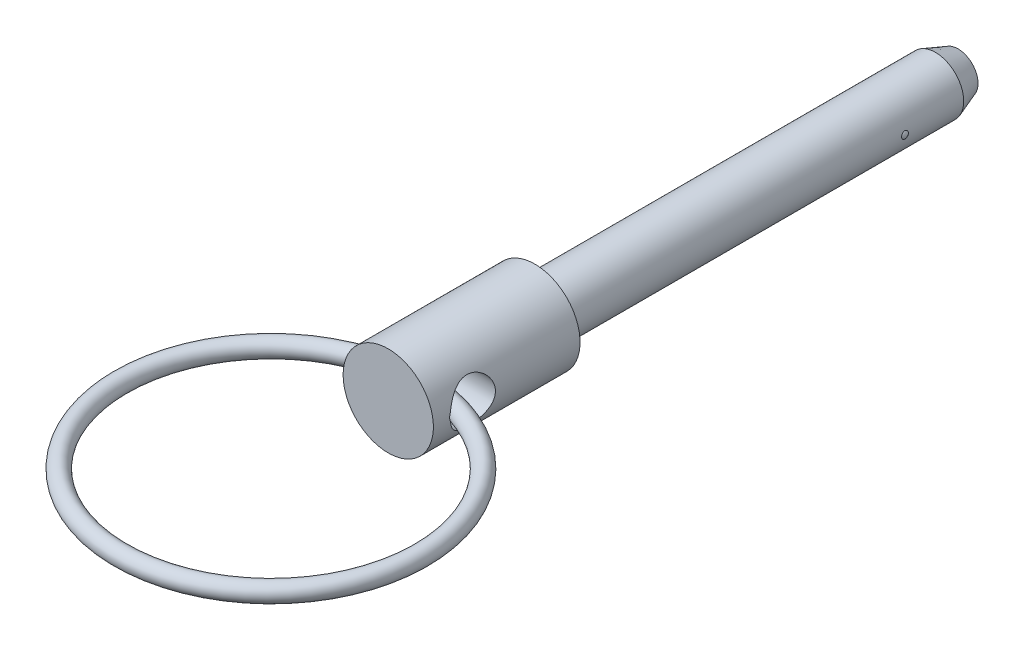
ISO-10303-21;
HEADER;
FILE_DESCRIPTION(('STEP AP214'),'2;1');
FILE_NAME('part.step','',(''),(''),'','','');
FILE_SCHEMA(('AUTOMOTIVE_DESIGN { 1 0 10303 214 1 1 1 1 }'));
ENDSEC;
DATA;
#1=APPLICATION_CONTEXT('core data for automotive mechanical design processes');
#2=APPLICATION_PROTOCOL_DEFINITION('international standard','automotive_design',2000,#1);
#3=PRODUCT_CONTEXT('',#1,'mechanical');
#4=PRODUCT('Part','Part','',(#3));
#5=PRODUCT_RELATED_PRODUCT_CATEGORY('part','',(#4));
#6=PRODUCT_DEFINITION_FORMATION('','',#4);
#7=PRODUCT_DEFINITION_CONTEXT('part definition',#1,'design');
#8=PRODUCT_DEFINITION('design','',#6,#7);
#9=PRODUCT_DEFINITION_SHAPE('','',#8);
#10=(LENGTH_UNIT() NAMED_UNIT(*) SI_UNIT(.MILLI.,.METRE.));
#11=(NAMED_UNIT(*) PLANE_ANGLE_UNIT() SI_UNIT($,.RADIAN.));
#12=(NAMED_UNIT(*) SI_UNIT($,.STERADIAN.) SOLID_ANGLE_UNIT());
#13=UNCERTAINTY_MEASURE_WITH_UNIT(LENGTH_MEASURE(1.E-05),#10,'distance_accuracy_value','');
#14=(GEOMETRIC_REPRESENTATION_CONTEXT(3) GLOBAL_UNCERTAINTY_ASSIGNED_CONTEXT((#13)) GLOBAL_UNIT_ASSIGNED_CONTEXT((#10,
#11,#12)) REPRESENTATION_CONTEXT('',''));
#15=CARTESIAN_POINT('',(0.,0.,0.));
#16=DIRECTION('',(0.,0.,1.));
#17=DIRECTION('',(1.,0.,0.));
#18=AXIS2_PLACEMENT_3D('',#15,#16,#17);
#19=CARTESIAN_POINT('',(0.,0.,14.9758741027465));
#20=DIRECTION('',(0.,0.,1.));
#21=DIRECTION('',(-1.,0.,0.));
#22=AXIS2_PLACEMENT_3D('',#19,#20,#21);
#23=CYLINDRICAL_SURFACE('',#22,4.00000000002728);
#24=CARTESIAN_POINT('',(0.,0.,12.9999999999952));
#25=DIRECTION('',(0.,0.,1.));
#26=DIRECTION('',(-1.,0.,0.));
#27=AXIS2_PLACEMENT_3D('',#24,#25,#26);
#28=CIRCLE('',#27,4.00000000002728);
#29=CARTESIAN_POINT('',(-4.00000000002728,0.,12.9999999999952));
#30=VERTEX_POINT('',#29);
#31=EDGE_CURVE('E61',#30,#30,#28,.T.);
#32=ORIENTED_EDGE('',*,*,#31,.F.);
#33=EDGE_LOOP('',(#32));
#34=FACE_BOUND('',#33,.T.);
#35=CARTESIAN_POINT('',(0.,0.,2.90531487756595E-11));
#36=DIRECTION('',(0.,0.,1.));
#37=DIRECTION('',(-1.,0.,0.));
#38=AXIS2_PLACEMENT_3D('',#35,#36,#37);
#39=CIRCLE('',#38,4.00000000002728);
#40=CARTESIAN_POINT('',(-4.00000000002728,0.,2.90531487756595E-11));
#41=VERTEX_POINT('',#40);
#42=EDGE_CURVE('E114',#41,#41,#39,.T.);
#43=ORIENTED_EDGE('',*,*,#42,.T.);
#44=EDGE_LOOP('',(#43));
#45=FACE_BOUND('',#44,.T.);
#46=CARTESIAN_POINT('',(3.99005038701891,0.281953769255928,9.92986493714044));
#47=CARTESIAN_POINT('',(3.98710361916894,0.323646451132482,9.94537015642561));
#48=CARTESIAN_POINT('',(3.98358785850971,0.364031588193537,9.96435084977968));
#49=CARTESIAN_POINT('',(3.97580260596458,0.441017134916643,10.008790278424));
#50=CARTESIAN_POINT('',(3.97153248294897,0.477614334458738,10.0342544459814));
#51=CARTESIAN_POINT('',(3.96271650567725,0.545954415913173,10.0909789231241));
#52=CARTESIAN_POINT('',(3.95817071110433,0.577698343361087,10.1222379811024));
#53=CARTESIAN_POINT('',(3.94931125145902,0.635450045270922,10.1896824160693));
#54=CARTESIAN_POINT('',(3.94499753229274,0.661459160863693,10.2258666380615));
#55=CARTESIAN_POINT('',(3.93708131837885,0.707055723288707,10.3020868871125));
#56=CARTESIAN_POINT('',(3.93347801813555,0.726650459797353,10.3421184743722));
#57=CARTESIAN_POINT('',(3.92735611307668,0.759043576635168,10.4249158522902));
#58=CARTESIAN_POINT('',(3.92483759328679,0.7718414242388,10.4676818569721));
#59=CARTESIAN_POINT('',(3.92109281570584,0.790648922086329,10.5555243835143));
#60=CARTESIAN_POINT('',(3.91989028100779,0.796534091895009,10.6006284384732));
#61=CARTESIAN_POINT('',(3.91894269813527,0.801182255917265,10.6912124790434));
#62=CARTESIAN_POINT('',(3.91919799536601,0.799943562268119,10.7366925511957));
#63=CARTESIAN_POINT('',(3.92114297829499,0.790356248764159,10.829192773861));
#64=CARTESIAN_POINT('',(3.92290466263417,0.781650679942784,10.8761742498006));
#65=CARTESIAN_POINT('',(3.92772482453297,0.757055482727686,10.9681516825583));
#66=CARTESIAN_POINT('',(3.93078377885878,0.741163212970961,11.0131469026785));
#67=CARTESIAN_POINT('',(3.93806499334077,0.701480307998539,11.1026764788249));
#68=CARTESIAN_POINT('',(3.94234583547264,0.677274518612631,11.1470226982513));
#69=CARTESIAN_POINT('',(3.95147153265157,0.621820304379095,11.2310343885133));
#70=CARTESIAN_POINT('',(3.95631656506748,0.590569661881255,11.2706983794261));
#71=CARTESIAN_POINT('',(3.9660181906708,0.521460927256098,11.3441933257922));
#72=CARTESIAN_POINT('',(3.97087472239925,0.483570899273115,11.3779944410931));
#73=CARTESIAN_POINT('',(3.97994547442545,0.402125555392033,11.4380257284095));
#74=CARTESIAN_POINT('',(3.98416017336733,0.358574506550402,11.4642615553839));
#75=CARTESIAN_POINT('',(3.99101820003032,0.271145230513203,11.5057266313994));
#76=CARTESIAN_POINT('',(3.99376828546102,0.227643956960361,11.5217298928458));
#77=CARTESIAN_POINT('',(3.9978554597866,0.138347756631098,11.5452375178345));
#78=CARTESIAN_POINT('',(3.99919394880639,0.0925551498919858,11.5527503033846));
#79=CARTESIAN_POINT('',(4.00020492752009,0.00564920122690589,11.5584330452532));
#80=CARTESIAN_POINT('',(4.00005022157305,-0.0354012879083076,11.5575719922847));
#81=CARTESIAN_POINT('',(3.99850330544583,-0.116721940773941,11.5488508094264));
#82=CARTESIAN_POINT('',(3.99711125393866,-0.156992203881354,11.5409915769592));
#83=CARTESIAN_POINT('',(3.99330536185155,-0.234470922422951,11.5190218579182));
#84=CARTESIAN_POINT('',(3.99092186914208,-0.271733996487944,11.5050965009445));
#85=CARTESIAN_POINT('',(3.98537855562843,-0.343596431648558,11.4716692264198));
#86=CARTESIAN_POINT('',(3.98221855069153,-0.378195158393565,11.4521659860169));
#87=CARTESIAN_POINT('',(3.97515535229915,-0.446551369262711,11.4066625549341));
#88=CARTESIAN_POINT('',(3.97121432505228,-0.48005403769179,11.380286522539));
#89=CARTESIAN_POINT('',(3.96314004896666,-0.542697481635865,11.3228119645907));
#90=CARTESIAN_POINT('',(3.95900671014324,-0.57183618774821,11.2917112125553));
#91=CARTESIAN_POINT('',(3.95044956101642,-0.628376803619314,11.2218573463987));
#92=CARTESIAN_POINT('',(3.94604615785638,-0.655204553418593,11.1826362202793));
#93=CARTESIAN_POINT('',(3.93791011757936,-0.702452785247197,11.1004353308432));
#94=CARTESIAN_POINT('',(3.93417778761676,-0.72287033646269,11.0574538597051));
#95=CARTESIAN_POINT('',(3.92755557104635,-0.758058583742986,10.9655943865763));
#96=CARTESIAN_POINT('',(3.92474503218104,-0.772320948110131,10.9165145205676));
#97=CARTESIAN_POINT('',(3.92073635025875,-0.792422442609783,10.8165862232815));
#98=CARTESIAN_POINT('',(3.91953811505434,-0.79826205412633,10.765737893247));
#99=CARTESIAN_POINT('',(3.91896964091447,-0.801049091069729,10.6645522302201));
#100=CARTESIAN_POINT('',(3.91957166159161,-0.798131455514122,10.6142190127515));
#101=CARTESIAN_POINT('',(3.92252995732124,-0.783463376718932,10.5149080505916));
#102=CARTESIAN_POINT('',(3.9248854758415,-0.771716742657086,10.4659297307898));
#103=CARTESIAN_POINT('',(3.93088557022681,-0.740520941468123,10.3740211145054));
#104=CARTESIAN_POINT('',(3.93443961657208,-0.721603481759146,10.3309041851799));
#105=CARTESIAN_POINT('',(3.94243966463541,-0.676528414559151,10.2487285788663));
#106=CARTESIAN_POINT('',(3.94688545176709,-0.650372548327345,10.2096689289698));
#107=CARTESIAN_POINT('',(3.95592540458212,-0.592842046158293,10.138445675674));
#108=CARTESIAN_POINT('',(3.96050463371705,-0.561744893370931,10.1060555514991));
#109=CARTESIAN_POINT('',(3.96946431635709,-0.494471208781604,10.0470379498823));
#110=CARTESIAN_POINT('',(3.97384478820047,-0.458295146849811,10.0204099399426));
#111=CARTESIAN_POINT('',(3.98187371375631,-0.382266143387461,9.97385565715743));
#112=CARTESIAN_POINT('',(3.98552868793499,-0.342451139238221,9.95386848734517));
#113=CARTESIAN_POINT('',(3.9917566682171,-0.259975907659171,9.92075319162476));
#114=CARTESIAN_POINT('',(3.99432946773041,-0.217315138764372,9.90762637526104));
#115=CARTESIAN_POINT('',(3.99811926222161,-0.130195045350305,9.88852098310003));
#116=CARTESIAN_POINT('',(3.99933102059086,-0.0857294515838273,9.88257000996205));
#117=CARTESIAN_POINT('',(4.00024701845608,0.00356373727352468,9.87805708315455));
#118=CARTESIAN_POINT('',(3.9999525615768,0.0483909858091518,9.8794887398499));
#119=CARTESIAN_POINT('',(3.99817522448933,0.125082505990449,9.88829599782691));
#120=CARTESIAN_POINT('',(3.99703656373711,0.157163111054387,9.8939529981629));
#121=CARTESIAN_POINT('',(3.99404982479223,0.220379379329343,9.90907748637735));
#122=CARTESIAN_POINT('',(3.9922017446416,0.251515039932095,9.91854498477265));
#123=CARTESIAN_POINT('',(3.99005038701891,0.281953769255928,9.92986493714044));
#124=B_SPLINE_CURVE_WITH_KNOTS('',3,(#46,#47,#48,#49,#50,#51,#52,#53,#54,#55,#56,#57,#58,#59,
#60,#61,#62,#63,#64,#65,#66,#67,#68,#69,#70,#71,#72,#73,#74,#75,#76,#77,#78,#79,#80,#81,#82,#83,
#84,#85,#86,#87,#88,#89,#90,#91,#92,#93,#94,#95,#96,#97,#98,#99,#100,#101,#102,#103,#104,#105,
#106,#107,#108,#109,#110,#111,#112,#113,#114,#115,#116,#117,#118,#119,#120,#121,#122,#123),
.UNSPECIFIED.,.T.,.F.,(4,2,2,2,2,2,2,2,2,2,2,2,2,2,2,2,2,2,2,2,2,2,2,2,2,2,2,2,2,2,2,2,2,2,2,2,
2,2,4),(0.,0.133622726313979,0.267357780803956,0.40106398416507,0.534738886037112,
0.668261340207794,0.801794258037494,0.93769660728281,1.07363115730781,1.2164509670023,
1.35932331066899,1.5107314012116,1.66218722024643,1.8143926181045,1.96648394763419,
2.1049852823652,2.24334911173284,2.36591145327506,2.488458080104,2.60750142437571,
2.72657302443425,2.85451767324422,2.98252280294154,3.12508196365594,3.26770620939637,
3.42053145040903,3.57334795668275,3.72382188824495,3.87423093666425,4.01516707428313,
4.15606933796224,4.29082406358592,4.42556633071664,4.55903651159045,4.69253216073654,
4.82653969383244,4.96043126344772,5.05798542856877,5.15553986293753),.UNSPECIFIED.);
#125=CARTESIAN_POINT('',(3.98515545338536,0.344290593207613,11.4701431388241));
#126=VERTEX_POINT('',#125);
#127=CARTESIAN_POINT('',(3.9851554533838,-0.344290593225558,11.4701431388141));
#128=VERTEX_POINT('',#127);
#129=EDGE_CURVE('E40',#126,#128,#124,.T.);
#130=ORIENTED_EDGE('',*,*,#129,.F.);
#131=CARTESIAN_POINT('',(3.46410161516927,-2.,9.5));
#132=CARTESIAN_POINT('',(3.46411185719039,-1.99999158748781,9.39578679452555));
#133=CARTESIAN_POINT('',(3.46887633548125,-1.99179963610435,9.29143782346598));
#134=CARTESIAN_POINT('',(3.48724701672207,-1.95944672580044,9.08594482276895));
#135=CARTESIAN_POINT('',(3.50087179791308,-1.93525221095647,8.98480799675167));
#136=CARTESIAN_POINT('',(3.53498701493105,-1.87219981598,8.78909684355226));
#137=CARTESIAN_POINT('',(3.55544089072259,-1.83341988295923,8.69449074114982));
#138=CARTESIAN_POINT('',(3.60085327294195,-1.74253507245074,8.51315154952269));
#139=CARTESIAN_POINT('',(3.62581202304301,-1.6904294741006,8.42641888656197));
#140=CARTESIAN_POINT('',(3.679937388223,-1.56933307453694,8.25538855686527));
#141=CARTESIAN_POINT('',(3.70928127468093,-1.49930407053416,8.1718817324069));
#142=CARTESIAN_POINT('',(3.76743965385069,-1.34650761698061,8.01718321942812));
#143=CARTESIAN_POINT('',(3.79625387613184,-1.26373385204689,7.94599767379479));
#144=CARTESIAN_POINT('',(3.8524295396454,-1.080979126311,7.81326569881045));
#145=CARTESIAN_POINT('',(3.879562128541,-0.980214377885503,7.75269246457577));
#146=CARTESIAN_POINT('',(3.92701512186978,-0.768314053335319,7.64971829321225));
#147=CARTESIAN_POINT('',(3.94733982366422,-0.657185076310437,7.60730588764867));
#148=CARTESIAN_POINT('',(3.97760922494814,-0.436089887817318,7.54499067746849));
#149=CARTESIAN_POINT('',(3.98818960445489,-0.326603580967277,7.52370094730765));
#150=CARTESIAN_POINT('',(4.00015167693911,-0.105141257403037,7.49966776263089));
#151=CARTESIAN_POINT('',(4.00153893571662,0.00683321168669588,7.49691308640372));
#152=CARTESIAN_POINT('',(3.99525963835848,0.21966504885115,7.50949334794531));
#153=CARTESIAN_POINT('',(3.98836991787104,0.320642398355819,7.5232760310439));
#154=CARTESIAN_POINT('',(3.96748490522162,0.51862754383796,7.56576168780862));
#155=CARTESIAN_POINT('',(3.95348908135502,0.615635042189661,7.59446577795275));
#156=CARTESIAN_POINT('',(3.91943166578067,0.804618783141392,7.66616513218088));
#157=CARTESIAN_POINT('',(3.89928883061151,0.896506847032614,7.70935262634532));
#158=CARTESIAN_POINT('',(3.85475291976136,1.07195360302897,7.80852683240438));
#159=CARTESIAN_POINT('',(3.83035832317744,1.15550929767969,7.86451812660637));
#160=CARTESIAN_POINT('',(3.77688788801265,1.32034732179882,7.99379070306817));
#161=CARTESIAN_POINT('',(3.74758751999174,1.40066815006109,8.06820605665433));
#162=CARTESIAN_POINT('',(3.68908681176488,1.54820874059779,8.22917944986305));
#163=CARTESIAN_POINT('',(3.65988656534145,1.6154184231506,8.31574674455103));
#164=CARTESIAN_POINT('',(3.60288312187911,1.73901066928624,8.50529638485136));
#165=CARTESIAN_POINT('',(3.57528639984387,1.79443462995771,8.60897204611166));
#166=CARTESIAN_POINT('',(3.52750900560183,1.88663822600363,8.82587534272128));
#167=CARTESIAN_POINT('',(3.50732060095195,1.92343731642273,8.9390928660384));
#168=CARTESIAN_POINT('',(3.47889271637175,1.97436042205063,9.1624290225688));
#169=CARTESIAN_POINT('',(3.46983311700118,1.99005024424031,9.27208223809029));
#170=CARTESIAN_POINT('',(3.46235838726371,2.00303389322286,9.49280268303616));
#171=CARTESIAN_POINT('',(3.46393573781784,2.00034071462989,9.60386885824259));
#172=CARTESIAN_POINT('',(3.47668673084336,1.97807208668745,9.81130783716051));
#173=CARTESIAN_POINT('',(3.48679175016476,1.96037563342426,9.90795890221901));
#174=CARTESIAN_POINT('',(3.51388043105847,1.91139256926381,10.0967355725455));
#175=CARTESIAN_POINT('',(3.5308663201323,1.88010155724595,10.1888597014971));
#176=CARTESIAN_POINT('',(3.57072444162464,1.80329517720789,10.370822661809));
#177=CARTESIAN_POINT('',(3.59383286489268,1.75718812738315,10.46035803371));
#178=CARTESIAN_POINT('',(3.64312238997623,1.65257412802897,10.6309385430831));
#179=CARTESIAN_POINT('',(3.66930506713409,1.59406080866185,10.7119792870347));
#180=CARTESIAN_POINT('',(3.72575996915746,1.45767433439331,10.8739575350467));
#181=CARTESIAN_POINT('',(3.75613166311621,1.37829054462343,10.9535943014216));
#182=CARTESIAN_POINT('',(3.81468469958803,1.20680899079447,11.0988244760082));
#183=CARTESIAN_POINT('',(3.84286530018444,1.11470694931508,11.1644131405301));
#184=CARTESIAN_POINT('',(3.89482723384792,0.917070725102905,11.2811474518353));
#185=CARTESIAN_POINT('',(3.91847283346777,0.811246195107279,11.3318662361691));
#186=CARTESIAN_POINT('',(3.95766709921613,0.591044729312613,11.4142758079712));
#187=CARTESIAN_POINT('',(3.97322287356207,0.476675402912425,11.4459833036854));
#188=CARTESIAN_POINT('',(3.99335016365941,0.253959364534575,11.4867371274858));
#189=CARTESIAN_POINT('',(3.99879855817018,0.146022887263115,11.4975957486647));
#190=CARTESIAN_POINT('',(4.00084260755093,-0.0702519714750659,11.5016865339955));
#191=CARTESIAN_POINT('',(3.99744136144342,-0.178590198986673,11.4949248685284));
#192=CARTESIAN_POINT('',(3.98267937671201,-0.385075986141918,11.4651671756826));
#193=CARTESIAN_POINT('',(3.97185789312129,-0.483424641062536,11.4432702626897));
#194=CARTESIAN_POINT('',(3.94384187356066,-0.674891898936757,11.3853460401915));
#195=CARTESIAN_POINT('',(3.92664642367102,-0.768009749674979,11.3493167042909));
#196=CARTESIAN_POINT('',(3.88651861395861,-0.950846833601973,11.2625457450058));
#197=CARTESIAN_POINT('',(3.86337234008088,-1.04025036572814,11.211240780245));
#198=CARTESIAN_POINT('',(3.81376266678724,-1.20954920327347,11.096084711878));
#199=CARTESIAN_POINT('',(3.78729774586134,-1.28944011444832,11.0322278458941));
#200=CARTESIAN_POINT('',(3.73057218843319,-1.44582833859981,10.8864033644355));
#201=CARTESIAN_POINT('',(3.70019591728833,-1.52119665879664,10.8032658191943));
#202=CARTESIAN_POINT('',(3.64126158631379,-1.65732528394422,10.6251077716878));
#203=CARTESIAN_POINT('',(3.6127051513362,-1.71807266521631,10.530076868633));
#204=CARTESIAN_POINT('',(3.55999186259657,-1.82486714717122,10.3266911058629));
#205=CARTESIAN_POINT('',(3.5360025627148,-1.8703890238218,10.2180100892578));
#206=CARTESIAN_POINT('',(3.50696218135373,-1.92395929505,10.0494218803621));
#207=CARTESIAN_POINT('',(3.49844389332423,-1.93935666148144,9.99235217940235));
#208=CARTESIAN_POINT('',(3.48406059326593,-1.96508069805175,9.87676744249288));
#209=CARTESIAN_POINT('',(3.47819372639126,-1.97541091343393,9.81825344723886));
#210=CARTESIAN_POINT('',(3.47059023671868,-1.9887293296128,9.71639921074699));
#211=CARTESIAN_POINT('',(3.46816389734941,-1.99295091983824,9.67326694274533));
#212=CARTESIAN_POINT('',(3.46491740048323,-1.99858810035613,9.5867643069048));
#213=CARTESIAN_POINT('',(3.46409735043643,-2.00000350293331,9.54339392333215));
#214=CARTESIAN_POINT('',(3.46410161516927,-2.,9.5));
#215=B_SPLINE_CURVE_WITH_KNOTS('',3,(#131,#132,#133,#134,#135,#136,#137,#138,#139,#140,#141,
#142,#143,#144,#145,#146,#147,#148,#149,#150,#151,#152,#153,#154,#155,#156,#157,#158,#159,#160,
#161,#162,#163,#164,#165,#166,#167,#168,#169,#170,#171,#172,#173,#174,#175,#176,#177,#178,#179,
#180,#181,#182,#183,#184,#185,#186,#187,#188,#189,#190,#191,#192,#193,#194,#195,#196,#197,#198,
#199,#200,#201,#202,#203,#204,#205,#206,#207,#208,#209,#210,#211,#212,#213,#214),.UNSPECIFIED.,
.T.,.F.,(4,2,2,2,2,2,2,2,2,2,2,2,2,2,2,2,2,2,2,2,2,2,2,2,2,2,2,2,2,2,2,2,2,2,2,2,2,2,2,2,2,4),
(0.,0.312464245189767,0.625585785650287,0.937057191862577,1.24854545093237,1.58572462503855,
1.92307142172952,2.283157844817,2.64301653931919,2.97726969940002,3.31132047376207,
3.61632194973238,3.92134625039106,4.23059069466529,4.53994598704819,4.87854382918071,
5.21740096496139,5.57777683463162,5.93777548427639,6.26924581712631,6.60048186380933,
6.89548366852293,7.19058104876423,7.49934592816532,7.80826972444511,8.15613487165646,
8.50411729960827,8.8612836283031,9.21813559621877,9.54224540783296,9.86624173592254,
10.1688884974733,10.4715786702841,10.7872150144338,11.1029966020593,11.4502048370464,
11.7977188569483,12.1562149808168,12.3351395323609,12.513938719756,12.6440387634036,
12.7741475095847),.UNSPECIFIED.);
#216=EDGE_CURVE('E52',#128,#126,#215,.T.);
#217=ORIENTED_EDGE('',*,*,#216,.F.);
#218=EDGE_LOOP('',(#130,#217));
#219=FACE_BOUND('',#218,.T.);
#220=CARTESIAN_POINT('',(-3.99005038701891,0.281953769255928,9.92986493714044));
#221=CARTESIAN_POINT('',(-3.99300741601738,0.240095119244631,9.91430139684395));
#222=CARTESIAN_POINT('',(-3.99539394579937,0.196873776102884,9.90222423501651));
#223=CARTESIAN_POINT('',(-3.99875840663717,0.10894998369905,9.88535960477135));
#224=CARTESIAN_POINT('',(-3.99973502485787,0.0642461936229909,9.88057893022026));
#225=CARTESIAN_POINT('',(-4.00017032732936,-0.0253314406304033,9.87843698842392));
#226=CARTESIAN_POINT('',(-3.99962961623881,-0.0702052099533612,9.88107276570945));
#227=CARTESIAN_POINT('',(-3.99709040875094,-0.158855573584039,9.89369477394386));
#228=CARTESIAN_POINT('',(-3.99509218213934,-0.202632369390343,9.90367964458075));
#229=CARTESIAN_POINT('',(-3.9898570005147,-0.287863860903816,9.93075746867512));
#230=CARTESIAN_POINT('',(-3.98661975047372,-0.329318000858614,9.94785211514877));
#231=CARTESIAN_POINT('',(-3.97926488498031,-0.408707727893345,9.98872052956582));
#232=CARTESIAN_POINT('',(-3.97514726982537,-0.446643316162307,10.0124942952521));
#233=CARTESIAN_POINT('',(-3.96650501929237,-0.517804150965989,10.0660180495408));
#234=CARTESIAN_POINT('',(-3.96198162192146,-0.551042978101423,10.0957501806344));
#235=CARTESIAN_POINT('',(-3.95302385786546,-0.612008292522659,10.1604189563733));
#236=CARTESIAN_POINT('',(-3.94858948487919,-0.639735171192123,10.1953552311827));
#237=CARTESIAN_POINT('',(-3.94031345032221,-0.688877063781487,10.2693392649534));
#238=CARTESIAN_POINT('',(-3.93647024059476,-0.710308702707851,10.3083758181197));
#239=CARTESIAN_POINT('',(-3.92977370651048,-0.746470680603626,10.3895111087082));
#240=CARTESIAN_POINT('',(-3.92692040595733,-0.761200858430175,10.4316099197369));
#241=CARTESIAN_POINT('',(-3.92245555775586,-0.783887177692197,10.5182713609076));
#242=CARTESIAN_POINT('',(-3.92086162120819,-0.791747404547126,10.5628599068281));
#243=CARTESIAN_POINT('',(-3.91911143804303,-0.800365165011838,10.652740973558));
#244=CARTESIAN_POINT('',(-3.91895550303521,-0.80112115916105,10.698033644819));
#245=CARTESIAN_POINT('',(-3.92007796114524,-0.795611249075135,10.7902748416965));
#246=CARTESIAN_POINT('',(-3.92142316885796,-0.789018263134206,10.837202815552));
#247=CARTESIAN_POINT('',(-3.92546548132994,-0.768652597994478,10.9294151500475));
#248=CARTESIAN_POINT('',(-3.92816306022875,-0.754877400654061,10.9746989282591));
#249=CARTESIAN_POINT('',(-3.93479992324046,-0.719508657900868,11.0652695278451));
#250=CARTESIAN_POINT('',(-3.93880557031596,-0.697485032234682,11.1103840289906));
#251=CARTESIAN_POINT('',(-3.94752061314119,-0.646337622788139,11.196342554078));
#252=CARTESIAN_POINT('',(-3.95223026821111,-0.617211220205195,11.2371849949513));
#253=CARTESIAN_POINT('',(-3.96188534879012,-0.551879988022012,11.3139586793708));
#254=CARTESIAN_POINT('',(-3.96683340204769,-0.515564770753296,11.349796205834));
#255=CARTESIAN_POINT('',(-3.97625988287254,-0.436941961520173,11.414255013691));
#256=CARTESIAN_POINT('',(-3.98073857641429,-0.39463779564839,11.4428803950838));
#257=CARTESIAN_POINT('',(-3.98829005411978,-0.308636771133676,11.4895001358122));
#258=CARTESIAN_POINT('',(-3.99144495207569,-0.265302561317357,11.5081469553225));
#259=CARTESIAN_POINT('',(-3.99638413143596,-0.175817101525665,11.5368761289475));
#260=CARTESIAN_POINT('',(-3.99816989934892,-0.129668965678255,11.5469677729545));
#261=CARTESIAN_POINT('',(-3.99999419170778,-0.0417967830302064,11.5572584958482));
#262=CARTESIAN_POINT('',(-4.00021432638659,-0.000194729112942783,11.5584860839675));
#263=CARTESIAN_POINT('',(-3.99936155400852,0.0825703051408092,11.5536924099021));
#264=CARTESIAN_POINT('',(-3.9982889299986,0.123733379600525,11.5476727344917));
#265=CARTESIAN_POINT('',(-3.99505363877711,0.202575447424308,11.5291543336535));
#266=CARTESIAN_POINT('',(-3.99294152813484,0.240327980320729,11.5169554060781));
#267=CARTESIAN_POINT('',(-3.98787194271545,0.31340150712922,11.4868260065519));
#268=CARTESIAN_POINT('',(-3.98491430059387,0.348722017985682,11.4688943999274));
#269=CARTESIAN_POINT('',(-3.97822434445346,0.418368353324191,11.4267056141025));
#270=CARTESIAN_POINT('',(-3.9744550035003,0.452491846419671,11.4021214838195));
#271=CARTESIAN_POINT('',(-3.96662805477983,0.516631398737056,11.3481231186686));
#272=CARTESIAN_POINT('',(-3.96257031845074,0.54664560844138,11.3187067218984));
#273=CARTESIAN_POINT('',(-3.9540631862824,0.605276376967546,11.2522992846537));
#274=CARTESIAN_POINT('',(-3.94962143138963,0.633350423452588,11.214827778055));
#275=CARTESIAN_POINT('',(-3.9412701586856,0.68339933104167,11.135950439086));
#276=CARTESIAN_POINT('',(-3.93736090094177,0.705371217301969,11.0945427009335));
#277=CARTESIAN_POINT('',(-3.93019522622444,0.744305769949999,11.0052774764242));
#278=CARTESIAN_POINT('',(-3.9270182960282,0.760712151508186,10.9571694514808));
#279=CARTESIAN_POINT('',(-3.92216984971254,0.785329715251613,10.8588172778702));
#280=CARTESIAN_POINT('',(-3.92049838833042,0.793540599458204,10.8085730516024));
#281=CARTESIAN_POINT('',(-3.91892501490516,0.801276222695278,10.7075574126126));
#282=CARTESIAN_POINT('',(-3.91901674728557,0.800832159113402,10.6567885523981));
#283=CARTESIAN_POINT('',(-3.92100845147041,0.791023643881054,10.5561554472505));
#284=CARTESIAN_POINT('',(-3.9229076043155,0.781663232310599,10.5062908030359));
#285=CARTESIAN_POINT('',(-3.9281461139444,0.754877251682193,10.4121456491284));
#286=CARTESIAN_POINT('',(-3.93139064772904,0.737977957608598,10.3677100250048));
#287=CARTESIAN_POINT('',(-3.93892368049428,0.696648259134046,10.2825763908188));
#288=CARTESIAN_POINT('',(-3.94321208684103,0.672218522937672,10.2418780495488));
#289=CARTESIAN_POINT('',(-3.95208501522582,0.617853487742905,10.1674080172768));
#290=CARTESIAN_POINT('',(-3.95664517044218,0.588241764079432,10.1333964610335));
#291=CARTESIAN_POINT('',(-3.96570971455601,0.523645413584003,10.0709664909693));
#292=CARTESIAN_POINT('',(-3.97021415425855,0.488666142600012,10.0425425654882));
#293=CARTESIAN_POINT('',(-3.97742706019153,0.425180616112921,9.99940040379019));
#294=CARTESIAN_POINT('',(-3.9802769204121,0.397749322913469,9.98310007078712));
#295=CARTESIAN_POINT('',(-3.98553180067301,0.341095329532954,9.95389443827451));
#296=CARTESIAN_POINT('',(-3.9879368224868,0.311872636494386,9.94098912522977));
#297=CARTESIAN_POINT('',(-3.99005038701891,0.281953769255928,9.92986493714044));
#298=B_SPLINE_CURVE_WITH_KNOTS('',3,(#220,#221,#222,#223,#224,#225,#226,#227,#228,#229,#230,
#231,#232,#233,#234,#235,#236,#237,#238,#239,#240,#241,#242,#243,#244,#245,#246,#247,#248,#249,
#250,#251,#252,#253,#254,#255,#256,#257,#258,#259,#260,#261,#262,#263,#264,#265,#266,#267,#268,
#269,#270,#271,#272,#273,#274,#275,#276,#277,#278,#279,#280,#281,#282,#283,#284,#285,#286,#287,
#288,#289,#290,#291,#292,#293,#294,#295,#296,#297),.UNSPECIFIED.,.T.,.F.,(4,2,2,2,2,2,2,2,2,2,2,
2,2,2,2,2,2,2,2,2,2,2,2,2,2,2,2,2,2,2,2,2,2,2,2,2,2,2,4),(0.,0.134152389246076,
0.268429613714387,0.402653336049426,0.536852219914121,0.671083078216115,0.805313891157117,
0.939148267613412,1.07297313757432,1.20644134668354,1.33991276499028,1.4752191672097,
1.61055488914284,1.75216328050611,1.89382135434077,2.04422271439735,2.19467961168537,
2.34765655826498,2.50054634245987,2.64157513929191,2.78245059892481,2.90667081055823,
3.03086382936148,3.14953805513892,3.26823578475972,3.39440010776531,3.52062102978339,
3.66112536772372,3.80169808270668,3.95376166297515,4.10583077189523,4.25735183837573,
4.4088042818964,4.55102684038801,4.6932367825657,4.82856596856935,4.96376098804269,
5.05964806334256,5.15553475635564),.UNSPECIFIED.);
#299=CARTESIAN_POINT('',(-3.98515545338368,-0.344290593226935,11.4701431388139));
#300=VERTEX_POINT('',#299);
#301=CARTESIAN_POINT('',(-3.98515545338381,0.344290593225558,11.4701431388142));
#302=VERTEX_POINT('',#301);
#303=EDGE_CURVE('E56',#300,#302,#298,.T.);
#304=ORIENTED_EDGE('',*,*,#303,.F.);
#305=CARTESIAN_POINT('',(-4.00000000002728,0.,7.5));
#306=CARTESIAN_POINT('',(-3.9999942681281,-0.105143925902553,7.50000660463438));
#307=CARTESIAN_POINT('',(-3.99580982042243,-0.2104131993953,7.50834014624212));
#308=CARTESIAN_POINT('',(-3.97948312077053,-0.417840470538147,7.54130576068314));
#309=CARTESIAN_POINT('',(-3.96732575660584,-0.519992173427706,7.56596878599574));
#310=CARTESIAN_POINT('',(-3.93632558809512,-0.717867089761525,7.63038761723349));
#311=CARTESIAN_POINT('',(-3.91750878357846,-0.81361360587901,7.67008476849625));
#312=CARTESIAN_POINT('',(-3.87491553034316,-0.996945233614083,7.76314124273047));
#313=CARTESIAN_POINT('',(-3.85113947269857,-1.08453098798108,7.81649948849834));
#314=CARTESIAN_POINT('',(-3.79912516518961,-1.25501563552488,7.93903449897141));
#315=CARTESIAN_POINT('',(-3.7707039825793,-1.33731042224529,8.00897295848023));
#316=CARTESIAN_POINT('',(-3.71319940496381,-1.48955888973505,8.16104295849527));
#317=CARTESIAN_POINT('',(-3.68411552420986,-1.55950316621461,8.24318370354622));
#318=CARTESIAN_POINT('',(-3.6259790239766,-1.6905040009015,8.42496669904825));
#319=CARTESIAN_POINT('',(-3.59710373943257,-1.75045067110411,8.52547219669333));
#320=CARTESIAN_POINT('',(-3.54571957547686,-1.852336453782,8.73673467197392));
#321=CARTESIAN_POINT('',(-3.5232061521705,-1.89428842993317,8.84748425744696));
#322=CARTESIAN_POINT('',(-3.48915734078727,-1.95626488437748,9.06933021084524));
#323=CARTESIAN_POINT('',(-3.47704543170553,-1.9774517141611,9.18000890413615));
#324=CARTESIAN_POINT('',(-3.46363779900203,-2.00085398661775,9.40395767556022));
#325=CARTESIAN_POINT('',(-3.46233138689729,-2.00308817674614,9.51722508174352));
#326=CARTESIAN_POINT('',(-3.4702186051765,-1.98937457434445,9.72857204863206));
#327=CARTESIAN_POINT('',(-3.47817527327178,-1.97556911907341,9.82684806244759));
#328=CARTESIAN_POINT('',(-3.50152457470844,-1.93387969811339,10.0194438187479));
#329=CARTESIAN_POINT('',(-3.51691957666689,-1.90599124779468,10.1137622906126));
#330=CARTESIAN_POINT('',(-3.55374952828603,-1.83641956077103,10.2984582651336));
#331=CARTESIAN_POINT('',(-3.57531681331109,-1.79443013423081,10.388692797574));
#332=CARTESIAN_POINT('',(-3.62206808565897,-1.69808337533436,10.5612685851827));
#333=CARTESIAN_POINT('',(-3.64725369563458,-1.64372048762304,10.6436062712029));
#334=CARTESIAN_POINT('',(-3.70226315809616,-1.51613210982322,10.8090425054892));
#335=CARTESIAN_POINT('',(-3.73227020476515,-1.441388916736,10.890913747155));
#336=CARTESIAN_POINT('',(-3.79095246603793,-1.2791111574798,11.0414708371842));
#337=CARTESIAN_POINT('',(-3.81962703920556,-1.19157051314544,11.1101503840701));
#338=CARTESIAN_POINT('',(-3.87403974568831,-1.00103301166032,11.2353713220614));
#339=CARTESIAN_POINT('',(-3.89957968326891,-0.897507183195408,11.2912009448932));
#340=CARTESIAN_POINT('',(-3.94315762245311,-0.680932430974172,11.3841940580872));
#341=CARTESIAN_POINT('',(-3.96120157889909,-0.567891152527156,11.4213723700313));
#342=CARTESIAN_POINT('',(-3.98648667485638,-0.345532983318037,11.4729508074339));
#343=CARTESIAN_POINT('',(-3.99449876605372,-0.236683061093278,11.488982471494));
#344=CARTESIAN_POINT('',(-4.00146026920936,-0.0175591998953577,11.502929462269));
#345=CARTESIAN_POINT('',(-4.00041397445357,0.0927140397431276,11.5008533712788));
#346=CARTESIAN_POINT('',(-3.98982384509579,0.302465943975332,11.479586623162));
#347=CARTESIAN_POINT('',(-3.98094491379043,0.402118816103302,11.4617349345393));
#348=CARTESIAN_POINT('',(-3.95644342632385,0.596813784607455,11.4115238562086));
#349=CARTESIAN_POINT('',(-3.94082012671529,0.691855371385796,11.3791628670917));
#350=CARTESIAN_POINT('',(-3.90368502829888,0.877777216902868,11.3000030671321));
#351=CARTESIAN_POINT('',(-3.88201763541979,0.968460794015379,11.2528178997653));
#352=CARTESIAN_POINT('',(-3.83487948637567,1.14092272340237,11.1457849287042));
#353=CARTESIAN_POINT('',(-3.80940711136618,1.22269725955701,11.0859317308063));
#354=CARTESIAN_POINT('',(-3.75416442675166,1.38353537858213,10.948479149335));
#355=CARTESIAN_POINT('',(-3.72421769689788,1.46154415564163,10.8697142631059));
#356=CARTESIAN_POINT('',(-3.66524783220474,1.60371264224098,10.7001496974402));
#357=CARTESIAN_POINT('',(-3.63622534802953,1.66786277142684,10.6093417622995));
#358=CARTESIAN_POINT('',(-3.58102384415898,1.7834158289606,10.412712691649));
#359=CARTESIAN_POINT('',(-3.55505059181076,1.83405099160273,10.306377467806));
#360=CARTESIAN_POINT('',(-3.51148144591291,1.91616565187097,10.0849798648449));
#361=CARTESIAN_POINT('',(-3.49387476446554,1.94766983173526,9.96992894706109));
#362=CARTESIAN_POINT('',(-3.47123002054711,1.98772337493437,9.74617955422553));
#363=CARTESIAN_POINT('',(-3.46514766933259,1.99818599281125,9.6379314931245));
#364=CARTESIAN_POINT('',(-3.46330709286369,2.00137830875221,9.42110586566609));
#365=CARTESIAN_POINT('',(-3.46754439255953,1.99411569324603,9.31252846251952));
#366=CARTESIAN_POINT('',(-3.48475724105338,1.96385225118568,9.10903299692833));
#367=CARTESIAN_POINT('',(-3.49686188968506,1.94241662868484,9.01379905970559));
#368=CARTESIAN_POINT('',(-3.52742032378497,1.88635071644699,8.8283837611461));
#369=CARTESIAN_POINT('',(-3.54587615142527,1.85171618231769,8.73820403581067));
#370=CARTESIAN_POINT('',(-3.58857060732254,1.76763149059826,8.55875029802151));
#371=CARTESIAN_POINT('',(-3.61311444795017,1.71734227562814,8.46994419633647));
#372=CARTESIAN_POINT('',(-3.66470663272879,1.60430194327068,8.30145092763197));
#373=CARTESIAN_POINT('',(-3.69175627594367,1.54154434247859,8.22176853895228));
#374=CARTESIAN_POINT('',(-3.74924646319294,1.3964066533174,8.06371603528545));
#375=CARTESIAN_POINT('',(-3.77969966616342,1.31256884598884,7.98668179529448));
#376=CARTESIAN_POINT('',(-3.83755504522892,1.13230961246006,7.84747403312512));
#377=CARTESIAN_POINT('',(-3.86495557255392,1.03588144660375,7.78530852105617));
#378=CARTESIAN_POINT('',(-3.91396019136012,0.831863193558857,7.67752727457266));
#379=CARTESIAN_POINT('',(-3.93552192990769,0.724199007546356,7.63203166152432));
#380=CARTESIAN_POINT('',(-3.97002682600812,0.501484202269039,7.56038366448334));
#381=CARTESIAN_POINT('',(-3.98299446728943,0.386455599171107,7.53417630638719));
#382=CARTESIAN_POINT('',(-3.9939092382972,0.225203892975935,7.51220517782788));
#383=CARTESIAN_POINT('',(-3.99618730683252,0.180323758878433,7.50763471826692));
#384=CARTESIAN_POINT('',(-3.99923393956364,0.0903034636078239,7.50153066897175));
#385=CARTESIAN_POINT('',(-4.0000024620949,0.0451632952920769,7.49999716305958));
#386=CARTESIAN_POINT('',(-4.00000000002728,0.,7.5));
#387=B_SPLINE_CURVE_WITH_KNOTS('',3,(#305,#306,#307,#308,#309,#310,#311,#312,#313,#314,#315,
#316,#317,#318,#319,#320,#321,#322,#323,#324,#325,#326,#327,#328,#329,#330,#331,#332,#333,#334,
#335,#336,#337,#338,#339,#340,#341,#342,#343,#344,#345,#346,#347,#348,#349,#350,#351,#352,#353,
#354,#355,#356,#357,#358,#359,#360,#361,#362,#363,#364,#365,#366,#367,#368,#369,#370,#371,#372,
#373,#374,#375,#376,#377,#378,#379,#380,#381,#382,#383,#384,#385,#386),.UNSPECIFIED.,.T.,.F.,(4,
2,2,2,2,2,2,2,2,2,2,2,2,2,2,2,2,2,2,2,2,2,2,2,2,2,2,2,2,2,2,2,2,2,2,2,2,2,2,2,4),(0.,
0.315248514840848,0.631096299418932,0.945724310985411,1.26032752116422,1.59396351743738,
1.92785247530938,2.28763452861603,2.64715895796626,2.98516024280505,3.3228271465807,
3.62011424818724,3.91749607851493,4.22180480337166,4.52625042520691,4.86929882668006,
5.21251069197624,5.57166044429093,5.93052433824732,6.25966580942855,6.58865129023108,
6.89213813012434,7.19565843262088,7.50785712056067,7.82018901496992,8.16319221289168,
8.5064317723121,8.86629364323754,9.22569023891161,9.55058615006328,9.87534119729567,
10.1691586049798,10.4630705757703,10.7767291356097,11.0905512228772,11.4425048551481,
11.7946476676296,12.1492802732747,12.5028981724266,12.6383056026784,12.7737167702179),.UNSPECIFIED.);
#388=EDGE_CURVE('E59',#302,#300,#387,.T.);
#389=ORIENTED_EDGE('',*,*,#388,.F.);
#390=EDGE_LOOP('',(#304,#389));
#391=FACE_BOUND('',#390,.T.);
#392=ADVANCED_FACE('F14',(#34,#45,#219,#391),#23,.T.);
#393=CARTESIAN_POINT('',(5.,0.,9.5));
#394=DIRECTION('',(-1.,0.,0.));
#395=DIRECTION('',(0.,-1.,0.));
#396=AXIS2_PLACEMENT_3D('',#393,#394,#395);
#397=CYLINDRICAL_SURFACE('',#396,2.);
#398=ORIENTED_EDGE('',*,*,#388,.T.);
#399=CARTESIAN_POINT('',(-4.01108315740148,-0.369511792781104,11.4655688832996));
#400=CARTESIAN_POINT('',(-3.99021138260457,-0.350083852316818,11.4692147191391));
#401=CARTESIAN_POINT('',(-3.97024619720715,-0.329516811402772,11.4727888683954));
#402=CARTESIAN_POINT('',(-3.93275440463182,-0.285678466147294,11.4796199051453));
#403=CARTESIAN_POINT('',(-3.91527020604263,-0.262370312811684,11.4828710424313));
#404=CARTESIAN_POINT('',(-3.88395406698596,-0.213038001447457,11.4887768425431));
#405=CARTESIAN_POINT('',(-3.87014971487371,-0.186995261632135,11.4914269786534));
#406=CARTESIAN_POINT('',(-3.84773626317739,-0.132819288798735,11.4957673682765));
#407=CARTESIAN_POINT('',(-3.83909292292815,-0.104701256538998,11.4974639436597));
#408=CARTESIAN_POINT('',(-3.82934402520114,-0.0542447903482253,11.4993828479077));
#409=CARTESIAN_POINT('',(-3.8269137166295,-0.0321704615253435,11.499863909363));
#410=CARTESIAN_POINT('',(-3.82579163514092,0.0120958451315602,11.500085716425));
#411=CARTESIAN_POINT('',(-3.82710196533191,0.034287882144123,11.4998260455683));
#412=CARTESIAN_POINT('',(-3.83333881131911,0.0780566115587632,11.498595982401));
#413=CARTESIAN_POINT('',(-3.83825432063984,0.0996349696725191,11.4976277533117));
#414=CARTESIAN_POINT('',(-3.8512832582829,0.141760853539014,11.4950816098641));
#415=CARTESIAN_POINT('',(-3.85939921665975,0.162307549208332,11.4935032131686));
#416=CARTESIAN_POINT('',(-3.88251041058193,0.210921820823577,11.489056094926));
#417=CARTESIAN_POINT('',(-3.89895987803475,0.238271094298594,11.4859257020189));
#418=CARTESIAN_POINT('',(-3.93589373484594,0.289965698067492,11.4790416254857));
#419=CARTESIAN_POINT('',(-3.9563842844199,0.314306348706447,11.4752869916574));
#420=CARTESIAN_POINT('',(-3.98891907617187,0.348315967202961,11.4694667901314));
#421=CARTESIAN_POINT('',(-3.99986593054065,0.359074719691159,11.467529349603));
#422=CARTESIAN_POINT('',(-4.01108315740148,0.369511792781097,11.4655688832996));
#423=B_SPLINE_CURVE_WITH_KNOTS('',3,(#399,#400,#401,#402,#403,#404,#405,#406,#407,#408,#409,
#410,#411,#412,#413,#414,#415,#416,#417,#418,#419,#420,#421,#422),.UNSPECIFIED.,.F.,.F.,(4,2,2,
2,2,2,2,2,2,2,2,4),(0.,0.0863607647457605,0.174054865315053,0.262389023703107,0.350130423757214,
0.41645969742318,0.482826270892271,0.548991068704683,0.615208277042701,0.710869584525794,
0.806677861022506,0.853049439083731),.UNSPECIFIED.);
#424=EDGE_CURVE('E33',#300,#302,#423,.T.);
#425=ORIENTED_EDGE('',*,*,#424,.T.);
#426=EDGE_LOOP('',(#398,#425));
#427=FACE_BOUND('',#426,.T.);
#428=ORIENTED_EDGE('',*,*,#216,.T.);
#429=CARTESIAN_POINT('',(4.01108315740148,0.369511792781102,11.4655688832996));
#430=CARTESIAN_POINT('',(3.99021138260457,0.35008385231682,11.4692147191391));
#431=CARTESIAN_POINT('',(3.97024619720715,0.329516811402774,11.4727888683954));
#432=CARTESIAN_POINT('',(3.93275440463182,0.285678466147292,11.4796199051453));
#433=CARTESIAN_POINT('',(3.91527020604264,0.262370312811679,11.4828710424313));
#434=CARTESIAN_POINT('',(3.88395406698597,0.213038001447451,11.4887768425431));
#435=CARTESIAN_POINT('',(3.87014971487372,0.186995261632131,11.4914269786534));
#436=CARTESIAN_POINT('',(3.84773626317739,0.132819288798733,11.4957673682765));
#437=CARTESIAN_POINT('',(3.83909292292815,0.104701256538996,11.4974639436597));
#438=CARTESIAN_POINT('',(3.82934402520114,0.0542447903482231,11.4993828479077));
#439=CARTESIAN_POINT('',(3.82691371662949,0.0321704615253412,11.499863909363));
#440=CARTESIAN_POINT('',(3.82579163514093,-0.0120958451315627,11.500085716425));
#441=CARTESIAN_POINT('',(3.82710196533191,-0.0342878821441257,11.4998260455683));
#442=CARTESIAN_POINT('',(3.83333881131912,-0.0780566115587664,11.498595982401));
#443=CARTESIAN_POINT('',(3.83825432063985,-0.0996349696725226,11.4976277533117));
#444=CARTESIAN_POINT('',(3.8512832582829,-0.141760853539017,11.4950816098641));
#445=CARTESIAN_POINT('',(3.85939921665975,-0.162307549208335,11.4935032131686));
#446=CARTESIAN_POINT('',(3.88251041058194,-0.210921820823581,11.489056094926));
#447=CARTESIAN_POINT('',(3.89895987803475,-0.238271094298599,11.4859257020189));
#448=CARTESIAN_POINT('',(3.93589373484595,-0.289965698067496,11.4790416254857));
#449=CARTESIAN_POINT('',(3.9563842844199,-0.314306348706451,11.4752869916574));
#450=CARTESIAN_POINT('',(3.98891907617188,-0.348315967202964,11.4694667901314));
#451=CARTESIAN_POINT('',(3.99986593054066,-0.359074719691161,11.467529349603));
#452=CARTESIAN_POINT('',(4.01108315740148,-0.369511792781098,11.4655688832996));
#453=B_SPLINE_CURVE_WITH_KNOTS('',3,(#429,#430,#431,#432,#433,#434,#435,#436,#437,#438,#439,
#440,#441,#442,#443,#444,#445,#446,#447,#448,#449,#450,#451,#452),.UNSPECIFIED.,.F.,.F.,(4,2,2,
2,2,2,2,2,2,2,2,4),(0.,0.0863607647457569,0.17405486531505,0.262389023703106,0.350130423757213,
0.416459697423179,0.48282627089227,0.548991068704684,0.615208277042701,0.710869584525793,
0.806677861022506,0.85304943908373),.UNSPECIFIED.);
#454=EDGE_CURVE('E46',#126,#128,#453,.T.);
#455=ORIENTED_EDGE('',*,*,#454,.T.);
#456=EDGE_LOOP('',(#428,#455));
#457=FACE_BOUND('',#456,.T.);
#458=ADVANCED_FACE('F58',(#427,#457),#397,.F.);
#459=CARTESIAN_POINT('',(0.,0.,14.9758741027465));
#460=DIRECTION('',(0.,0.,1.));
#461=DIRECTION('',(-1.,0.,0.));
#462=AXIS2_PLACEMENT_3D('',#459,#460,#461);
#463=CYLINDRICAL_SURFACE('',#462,2.4999797);
#464=CARTESIAN_POINT('',(2.47854667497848,-0.326657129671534,-30.30003045));
#465=CARTESIAN_POINT('',(2.47854700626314,-0.326655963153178,-30.3164932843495));
#466=CARTESIAN_POINT('',(2.47874269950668,-0.325180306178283,-30.3329729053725));
#467=CARTESIAN_POINT('',(2.479501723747,-0.319339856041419,-30.3654189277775));
#468=CARTESIAN_POINT('',(2.48006564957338,-0.314970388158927,-30.3813844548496));
#469=CARTESIAN_POINT('',(2.48148901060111,-0.303551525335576,-30.4122606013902));
#470=CARTESIAN_POINT('',(2.48234765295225,-0.296509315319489,-30.4271739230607));
#471=CARTESIAN_POINT('',(2.48426009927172,-0.280033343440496,-30.4555892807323));
#472=CARTESIAN_POINT('',(2.48531386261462,-0.270600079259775,-30.4690916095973));
#473=CARTESIAN_POINT('',(2.48750023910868,-0.249701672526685,-30.4943611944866));
#474=CARTESIAN_POINT('',(2.48863269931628,-0.23824040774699,-30.5061316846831));
#475=CARTESIAN_POINT('',(2.49086582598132,-0.213631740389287,-30.5277524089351));
#476=CARTESIAN_POINT('',(2.49196648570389,-0.200483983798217,-30.5376022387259));
#477=CARTESIAN_POINT('',(2.49411877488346,-0.171737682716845,-30.5559476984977));
#478=CARTESIAN_POINT('',(2.49515918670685,-0.15602685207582,-30.5642686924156));
#479=CARTESIAN_POINT('',(2.49698106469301,-0.123490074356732,-30.5783717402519));
#480=CARTESIAN_POINT('',(2.49776243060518,-0.106663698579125,-30.5841528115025));
#481=CARTESIAN_POINT('',(2.49903703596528,-0.0710736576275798,-30.5934285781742));
#482=CARTESIAN_POINT('',(2.49950533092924,-0.0522579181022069,-30.5967275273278));
#483=CARTESIAN_POINT('',(2.50001059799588,-0.0143339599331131,-30.6002822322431));
#484=CARTESIAN_POINT('',(2.50004745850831,0.00477433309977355,-30.6005372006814));
#485=CARTESIAN_POINT('',(2.49967861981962,0.043533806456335,-30.5979493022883));
#486=CARTESIAN_POINT('',(2.4992554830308,0.0631768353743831,-30.594984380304));
#487=CARTESIAN_POINT('',(2.49798548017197,0.101676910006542,-30.5857987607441));
#488=CARTESIAN_POINT('',(2.49713858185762,0.120533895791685,-30.5795778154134));
#489=CARTESIAN_POINT('',(2.49512848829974,0.156708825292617,-30.564043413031));
#490=CARTESIAN_POINT('',(2.49396828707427,0.174039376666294,-30.554759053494));
#491=CARTESIAN_POINT('',(2.49146927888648,0.206757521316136,-30.5332467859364));
#492=CARTESIAN_POINT('',(2.49013052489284,0.222145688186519,-30.5210197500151));
#493=CARTESIAN_POINT('',(2.48752981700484,0.249545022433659,-30.4946883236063));
#494=CARTESIAN_POINT('',(2.48626792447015,0.261700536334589,-30.480734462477));
#495=CARTESIAN_POINT('',(2.48390693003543,0.283236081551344,-30.450814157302));
#496=CARTESIAN_POINT('',(2.48280772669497,0.292617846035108,-30.434848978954));
#497=CARTESIAN_POINT('',(2.48100672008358,0.307499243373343,-30.4028228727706));
#498=CARTESIAN_POINT('',(2.48027911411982,0.313260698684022,-30.3868849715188));
#499=CARTESIAN_POINT('',(2.47918259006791,0.321824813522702,-30.3542223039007));
#500=CARTESIAN_POINT('',(2.47881349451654,0.324628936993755,-30.3374979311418));
#501=CARTESIAN_POINT('',(2.47849376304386,0.327060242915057,-30.3049667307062));
#502=CARTESIAN_POINT('',(2.47851631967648,0.326890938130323,-30.2891750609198));
#503=CARTESIAN_POINT('',(2.47891182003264,0.3238780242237,-30.257855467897));
#504=CARTESIAN_POINT('',(2.47928471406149,0.32103479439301,-30.2423275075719));
#505=CARTESIAN_POINT('',(2.48032929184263,0.312860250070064,-30.2122223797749));
#506=CARTESIAN_POINT('',(2.48099611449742,0.307569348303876,-30.1976339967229));
#507=CARTESIAN_POINT('',(2.48255561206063,0.294716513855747,-30.1695103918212));
#508=CARTESIAN_POINT('',(2.48344831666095,0.287154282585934,-30.1559753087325));
#509=CARTESIAN_POINT('',(2.48540810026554,0.269676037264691,-30.1297456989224));
#510=CARTESIAN_POINT('',(2.48648071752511,0.259678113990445,-30.1171062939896));
#511=CARTESIAN_POINT('',(2.48866494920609,0.237835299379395,-30.0935464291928));
#512=CARTESIAN_POINT('',(2.48977657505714,0.225989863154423,-30.0826264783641));
#513=CARTESIAN_POINT('',(2.49201556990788,0.199852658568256,-30.0619462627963));
#514=CARTESIAN_POINT('',(2.49313795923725,0.185444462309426,-30.052332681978));
#515=CARTESIAN_POINT('',(2.49519694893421,0.155303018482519,-30.035451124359));
#516=CARTESIAN_POINT('',(2.49613348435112,0.139569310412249,-30.0281839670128));
#517=CARTESIAN_POINT('',(2.49779619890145,0.105913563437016,-30.0156180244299));
#518=CARTESIAN_POINT('',(2.49850029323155,0.087916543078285,-30.0105168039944));
#519=CARTESIAN_POINT('',(2.49951970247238,0.0513318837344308,-30.0032146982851));
#520=CARTESIAN_POINT('',(2.49983489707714,0.0327440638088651,-30.0010147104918));
#521=CARTESIAN_POINT('',(2.50005053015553,-0.00552959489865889,-29.9995032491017));
#522=CARTESIAN_POINT('',(2.49992838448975,-0.0252219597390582,-30.0003490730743));
#523=CARTESIAN_POINT('',(2.49923142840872,-0.0641937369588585,-30.0052737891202));
#524=CARTESIAN_POINT('',(2.49865654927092,-0.0834730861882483,-30.0093531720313));
#525=CARTESIAN_POINT('',(2.49711189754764,-0.121201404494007,-30.0207347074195));
#526=CARTESIAN_POINT('',(2.49613922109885,-0.139643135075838,-30.0280605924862));
#527=CARTESIAN_POINT('',(2.4939136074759,-0.174946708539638,-30.045827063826));
#528=CARTESIAN_POINT('',(2.49266072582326,-0.191808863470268,-30.0562670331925));
#529=CARTESIAN_POINT('',(2.49009147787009,-0.222648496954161,-30.0795378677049));
#530=CARTESIAN_POINT('',(2.48878024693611,-0.236719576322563,-30.0922449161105));
#531=CARTESIAN_POINT('',(2.48621473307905,-0.262298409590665,-30.1200364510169));
#532=CARTESIAN_POINT('',(2.48496043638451,-0.273806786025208,-30.1351203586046));
#533=CARTESIAN_POINT('',(2.48277540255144,-0.292934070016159,-30.165945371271));
#534=CARTESIAN_POINT('',(2.48182685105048,-0.300789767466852,-30.1815384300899));
#535=CARTESIAN_POINT('',(2.4802514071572,-0.313517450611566,-30.2138934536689));
#536=CARTESIAN_POINT('',(2.47962381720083,-0.318395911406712,-30.2306527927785));
#537=CARTESIAN_POINT('',(2.47898367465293,-0.323327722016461,-30.256322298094));
#538=CARTESIAN_POINT('',(2.4788204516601,-0.324574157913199,-30.2650144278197));
#539=CARTESIAN_POINT('',(2.47860186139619,-0.326239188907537,-30.2824795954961));
#540=CARTESIAN_POINT('',(2.47854649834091,-0.326657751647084,-30.291252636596));
#541=CARTESIAN_POINT('',(2.47854667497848,-0.326657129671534,-30.30003045));
#542=B_SPLINE_CURVE_WITH_KNOTS('',3,(#464,#465,#466,#467,#468,#469,#470,#471,#472,#473,#474,
#475,#476,#477,#478,#479,#480,#481,#482,#483,#484,#485,#486,#487,#488,#489,#490,#491,#492,#493,
#494,#495,#496,#497,#498,#499,#500,#501,#502,#503,#504,#505,#506,#507,#508,#509,#510,#511,#512,
#513,#514,#515,#516,#517,#518,#519,#520,#521,#522,#523,#524,#525,#526,#527,#528,#529,#530,#531,
#532,#533,#534,#535,#536,#537,#538,#539,#540,#541),.UNSPECIFIED.,.T.,.F.,(4,2,2,2,2,2,2,2,2,2,2,
2,2,2,2,2,2,2,2,2,2,2,2,2,2,2,2,2,2,2,2,2,2,2,2,2,2,2,4),(0.,0.0493517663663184,
0.0987834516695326,0.148083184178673,0.197372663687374,0.246568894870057,0.295775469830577,
0.348973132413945,0.402191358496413,0.459261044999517,0.51634549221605,0.575671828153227,
0.635002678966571,0.693785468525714,0.752550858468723,0.807898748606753,0.863211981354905,
0.913832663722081,0.964428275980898,1.01157529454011,1.05871562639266,1.10510398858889,
1.15149845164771,1.19974491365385,1.24800563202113,1.29985620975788,1.35172487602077,
1.40763626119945,1.46356493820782,1.52242246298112,1.5812889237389,1.64059299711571,
1.69988533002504,1.75659740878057,1.81329569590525,1.8654778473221,1.91754610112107,
1.94385892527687,1.97017277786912),.UNSPECIFIED.);
#543=CARTESIAN_POINT('',(2.47854667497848,-0.326657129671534,-30.30003045));
#544=VERTEX_POINT('',#543);
#545=EDGE_CURVE('E27',#544,#544,#542,.T.);
#546=ORIENTED_EDGE('',*,*,#545,.F.);
#547=EDGE_LOOP('',(#546));
#548=FACE_BOUND('',#547,.T.);
#549=CARTESIAN_POINT('',(0.,0.,2.90531487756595E-11));
#550=DIRECTION('',(0.,0.,1.));
#551=DIRECTION('',(-1.,0.,0.));
#552=AXIS2_PLACEMENT_3D('',#549,#550,#551);
#553=CIRCLE('',#552,2.4999797);
#554=CARTESIAN_POINT('',(-2.4999797,0.,2.90531487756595E-11));
#555=VERTEX_POINT('',#554);
#556=EDGE_CURVE('E117',#555,#555,#553,.T.);
#557=ORIENTED_EDGE('',*,*,#556,.F.);
#558=EDGE_LOOP('',(#557));
#559=FACE_BOUND('',#558,.T.);
#560=CARTESIAN_POINT('',(0.,0.,-35.5));
#561=DIRECTION('',(0.,0.,1.));
#562=DIRECTION('',(-1.,0.,0.));
#563=AXIS2_PLACEMENT_3D('',#560,#561,#562);
#564=CIRCLE('',#563,2.4999797);
#565=CARTESIAN_POINT('',(-2.4999797,0.,-35.5));
#566=VERTEX_POINT('',#565);
#567=EDGE_CURVE('E119',#566,#566,#564,.T.);
#568=ORIENTED_EDGE('',*,*,#567,.T.);
#569=EDGE_LOOP('',(#568));
#570=FACE_BOUND('',#569,.T.);
#571=CARTESIAN_POINT('',(-2.47854667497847,0.32665712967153,-30.30003045));
#572=CARTESIAN_POINT('',(-2.47854700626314,0.326655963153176,-30.3164932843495));
#573=CARTESIAN_POINT('',(-2.47874269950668,0.325180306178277,-30.3329729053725));
#574=CARTESIAN_POINT('',(-2.47950172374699,0.319339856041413,-30.3654189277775));
#575=CARTESIAN_POINT('',(-2.48006564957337,0.314970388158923,-30.3813844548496));
#576=CARTESIAN_POINT('',(-2.4814890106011,0.303551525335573,-30.4122606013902));
#577=CARTESIAN_POINT('',(-2.48234765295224,0.296509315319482,-30.4271739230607));
#578=CARTESIAN_POINT('',(-2.48426009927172,0.280033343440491,-30.4555892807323));
#579=CARTESIAN_POINT('',(-2.48531386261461,0.270600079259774,-30.4690916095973));
#580=CARTESIAN_POINT('',(-2.48750023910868,0.249701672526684,-30.4943611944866));
#581=CARTESIAN_POINT('',(-2.48863269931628,0.238240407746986,-30.5061316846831));
#582=CARTESIAN_POINT('',(-2.49086582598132,0.213631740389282,-30.5277524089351));
#583=CARTESIAN_POINT('',(-2.49196648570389,0.200483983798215,-30.5376022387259));
#584=CARTESIAN_POINT('',(-2.49411877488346,0.171737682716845,-30.5559476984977));
#585=CARTESIAN_POINT('',(-2.49515918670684,0.156026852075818,-30.5642686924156));
#586=CARTESIAN_POINT('',(-2.49698106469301,0.12349007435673,-30.5783717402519));
#587=CARTESIAN_POINT('',(-2.49776243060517,0.106663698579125,-30.5841528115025));
#588=CARTESIAN_POINT('',(-2.49903703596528,0.0710736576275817,-30.5934285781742));
#589=CARTESIAN_POINT('',(-2.49950533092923,0.0522579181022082,-30.5967275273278));
#590=CARTESIAN_POINT('',(-2.50001059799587,0.0143339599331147,-30.6002822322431));
#591=CARTESIAN_POINT('',(-2.5000474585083,-0.00477433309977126,-30.6005372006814));
#592=CARTESIAN_POINT('',(-2.49967861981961,-0.043533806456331,-30.5979493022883));
#593=CARTESIAN_POINT('',(-2.49925548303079,-0.0631768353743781,-30.594984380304));
#594=CARTESIAN_POINT('',(-2.49798548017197,-0.101676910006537,-30.5857987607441));
#595=CARTESIAN_POINT('',(-2.49713858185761,-0.120533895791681,-30.5795778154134));
#596=CARTESIAN_POINT('',(-2.49512848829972,-0.156708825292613,-30.564043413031));
#597=CARTESIAN_POINT('',(-2.49396828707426,-0.174039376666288,-30.554759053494));
#598=CARTESIAN_POINT('',(-2.49146927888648,-0.20675752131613,-30.5332467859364));
#599=CARTESIAN_POINT('',(-2.49013052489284,-0.222145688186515,-30.5210197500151));
#600=CARTESIAN_POINT('',(-2.48752981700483,-0.249545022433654,-30.4946883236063));
#601=CARTESIAN_POINT('',(-2.48626792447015,-0.261700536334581,-30.480734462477));
#602=CARTESIAN_POINT('',(-2.48390693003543,-0.283236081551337,-30.450814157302));
#603=CARTESIAN_POINT('',(-2.48280772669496,-0.292617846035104,-30.434848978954));
#604=CARTESIAN_POINT('',(-2.48100672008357,-0.30749924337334,-30.4028228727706));
#605=CARTESIAN_POINT('',(-2.48027911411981,-0.313260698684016,-30.3868849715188));
#606=CARTESIAN_POINT('',(-2.47918259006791,-0.321824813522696,-30.3542223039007));
#607=CARTESIAN_POINT('',(-2.47881349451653,-0.324628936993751,-30.3374979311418));
#608=CARTESIAN_POINT('',(-2.47849376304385,-0.327060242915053,-30.3049667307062));
#609=CARTESIAN_POINT('',(-2.47851631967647,-0.326890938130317,-30.2891750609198));
#610=CARTESIAN_POINT('',(-2.47891182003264,-0.323878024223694,-30.257855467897));
#611=CARTESIAN_POINT('',(-2.47928471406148,-0.321034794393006,-30.2423275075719));
#612=CARTESIAN_POINT('',(-2.48032929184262,-0.312860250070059,-30.2122223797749));
#613=CARTESIAN_POINT('',(-2.48099611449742,-0.307569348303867,-30.1976339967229));
#614=CARTESIAN_POINT('',(-2.48255561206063,-0.294716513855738,-30.1695103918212));
#615=CARTESIAN_POINT('',(-2.48344831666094,-0.287154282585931,-30.1559753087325));
#616=CARTESIAN_POINT('',(-2.48540810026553,-0.26967603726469,-30.1297456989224));
#617=CARTESIAN_POINT('',(-2.4864807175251,-0.25967811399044,-30.1171062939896));
#618=CARTESIAN_POINT('',(-2.48866494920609,-0.23783529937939,-30.0935464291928));
#619=CARTESIAN_POINT('',(-2.48977657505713,-0.225989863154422,-30.0826264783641));
#620=CARTESIAN_POINT('',(-2.49201556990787,-0.199852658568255,-30.0619462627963));
#621=CARTESIAN_POINT('',(-2.49313795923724,-0.185444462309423,-30.052332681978));
#622=CARTESIAN_POINT('',(-2.49519694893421,-0.155303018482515,-30.035451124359));
#623=CARTESIAN_POINT('',(-2.49613348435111,-0.139569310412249,-30.0281839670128));
#624=CARTESIAN_POINT('',(-2.49779619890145,-0.105913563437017,-30.0156180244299));
#625=CARTESIAN_POINT('',(-2.49850029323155,-0.0879165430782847,-30.0105168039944));
#626=CARTESIAN_POINT('',(-2.49951970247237,-0.0513318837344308,-30.0032146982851));
#627=CARTESIAN_POINT('',(-2.49983489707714,-0.0327440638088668,-30.0010147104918));
#628=CARTESIAN_POINT('',(-2.50005053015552,0.00552959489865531,-29.9995032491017));
#629=CARTESIAN_POINT('',(-2.49992838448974,0.0252219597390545,-30.0003490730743));
#630=CARTESIAN_POINT('',(-2.49923142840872,0.0641937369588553,-30.0052737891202));
#631=CARTESIAN_POINT('',(-2.49865654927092,0.0834730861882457,-30.0093531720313));
#632=CARTESIAN_POINT('',(-2.49711189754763,0.121201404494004,-30.0207347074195));
#633=CARTESIAN_POINT('',(-2.49613922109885,0.139643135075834,-30.0280605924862));
#634=CARTESIAN_POINT('',(-2.49391360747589,0.174946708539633,-30.045827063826));
#635=CARTESIAN_POINT('',(-2.49266072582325,0.191808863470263,-30.0562670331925));
#636=CARTESIAN_POINT('',(-2.49009147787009,0.222648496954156,-30.0795378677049));
#637=CARTESIAN_POINT('',(-2.4887802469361,0.236719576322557,-30.0922449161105));
#638=CARTESIAN_POINT('',(-2.48621473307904,0.26229840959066,-30.1200364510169));
#639=CARTESIAN_POINT('',(-2.4849604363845,0.273806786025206,-30.1351203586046));
#640=CARTESIAN_POINT('',(-2.48277540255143,0.292934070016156,-30.165945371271));
#641=CARTESIAN_POINT('',(-2.48182685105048,0.300789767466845,-30.1815384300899));
#642=CARTESIAN_POINT('',(-2.4802514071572,0.313517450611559,-30.2138934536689));
#643=CARTESIAN_POINT('',(-2.47962381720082,0.318395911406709,-30.2306527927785));
#644=CARTESIAN_POINT('',(-2.47898367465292,0.323327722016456,-30.256322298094));
#645=CARTESIAN_POINT('',(-2.47882045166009,0.324574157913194,-30.2650144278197));
#646=CARTESIAN_POINT('',(-2.47860186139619,0.326239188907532,-30.2824795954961));
#647=CARTESIAN_POINT('',(-2.4785464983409,0.32665775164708,-30.291252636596));
#648=CARTESIAN_POINT('',(-2.47854667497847,0.32665712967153,-30.30003045));
#649=B_SPLINE_CURVE_WITH_KNOTS('',3,(#571,#572,#573,#574,#575,#576,#577,#578,#579,#580,#581,
#582,#583,#584,#585,#586,#587,#588,#589,#590,#591,#592,#593,#594,#595,#596,#597,#598,#599,#600,
#601,#602,#603,#604,#605,#606,#607,#608,#609,#610,#611,#612,#613,#614,#615,#616,#617,#618,#619,
#620,#621,#622,#623,#624,#625,#626,#627,#628,#629,#630,#631,#632,#633,#634,#635,#636,#637,#638,
#639,#640,#641,#642,#643,#644,#645,#646,#647,#648),.UNSPECIFIED.,.T.,.F.,(4,2,2,2,2,2,2,2,2,2,2,
2,2,2,2,2,2,2,2,2,2,2,2,2,2,2,2,2,2,2,2,2,2,2,2,2,2,2,4),(0.,0.0493517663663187,
0.0987834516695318,0.14808318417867,0.197372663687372,0.246568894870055,0.295775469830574,
0.348973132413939,0.402191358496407,0.459261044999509,0.51634549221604,0.575671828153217,
0.635002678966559,0.693785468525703,0.75255085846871,0.807898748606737,0.863211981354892,
0.913832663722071,0.964428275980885,1.01157529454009,1.05871562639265,1.10510398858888,
1.15149845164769,1.19974491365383,1.24800563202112,1.29985620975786,1.35172487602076,
1.40763626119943,1.46356493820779,1.52242246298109,1.58128892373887,1.64059299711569,
1.69988533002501,1.75659740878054,1.81329569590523,1.86547784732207,1.91754610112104,
1.94385892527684,1.97017277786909),.UNSPECIFIED.);
#650=CARTESIAN_POINT('',(-2.47854667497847,0.32665712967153,-30.30003045));
#651=VERTEX_POINT('',#650);
#652=EDGE_CURVE('E9',#651,#651,#649,.T.);
#653=ORIENTED_EDGE('',*,*,#652,.F.);
#654=EDGE_LOOP('',(#653));
#655=FACE_BOUND('',#654,.T.);
#656=ADVANCED_FACE('F80',(#548,#559,#570,#655),#463,.T.);
#657=CARTESIAN_POINT('',(1.77203802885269,0.,-37.5));
#658=DIRECTION('',(0.,0.,1.));
#659=DIRECTION('',(-1.,0.,0.));
#660=AXIS2_PLACEMENT_3D('',#657,#658,#659);
#661=PLANE('',#660);
#662=CARTESIAN_POINT('',(0.,0.,-37.5));
#663=DIRECTION('',(0.,0.,1.));
#664=DIRECTION('',(-1.,0.,0.));
#665=AXIS2_PLACEMENT_3D('',#662,#663,#664);
#666=CIRCLE('',#665,1.77203802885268);
#667=CARTESIAN_POINT('',(-1.77203802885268,0.,-37.5));
#668=VERTEX_POINT('',#667);
#669=EDGE_CURVE('E69',#668,#668,#666,.T.);
#670=ORIENTED_EDGE('',*,*,#669,.F.);
#671=EDGE_LOOP('',(#670));
#672=FACE_BOUND('',#671,.T.);
#673=ADVANCED_FACE('F16',(#672),#661,.F.);
#674=CARTESIAN_POINT('',(0.,0.,-37.5));
#675=DIRECTION('',(0.,0.,1.));
#676=DIRECTION('',(-1.,0.,0.));
#677=AXIS2_PLACEMENT_3D('',#674,#675,#676);
#678=CONICAL_SURFACE('',#677,1.77203802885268,0.349066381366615);
#679=ORIENTED_EDGE('',*,*,#567,.F.);
#680=EDGE_LOOP('',(#679));
#681=FACE_BOUND('',#680,.T.);
#682=ORIENTED_EDGE('',*,*,#669,.T.);
#683=EDGE_LOOP('',(#682));
#684=FACE_BOUND('',#683,.T.);
#685=ADVANCED_FACE('F136',(#681,#684),#678,.T.);
#686=CARTESIAN_POINT('',(4.00000000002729,0.,2.90535481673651E-11));
#687=DIRECTION('',(0.,0.,1.));
#688=DIRECTION('',(-1.,0.,0.));
#689=AXIS2_PLACEMENT_3D('',#686,#687,#688);
#690=PLANE('',#689);
#691=ORIENTED_EDGE('',*,*,#42,.F.);
#692=EDGE_LOOP('',(#691));
#693=FACE_BOUND('',#692,.T.);
#694=ORIENTED_EDGE('',*,*,#556,.T.);
#695=EDGE_LOOP('',(#694));
#696=FACE_BOUND('',#695,.T.);
#697=ADVANCED_FACE('F135',(#693,#696),#690,.F.);
#698=CARTESIAN_POINT('',(4.00000000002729,0.,12.9999999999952));
#699=DIRECTION('',(0.,0.,-1.));
#700=DIRECTION('',(1.,0.,0.));
#701=AXIS2_PLACEMENT_3D('',#698,#699,#700);
#702=PLANE('',#701);
#703=ORIENTED_EDGE('',*,*,#31,.T.);
#704=EDGE_LOOP('',(#703));
#705=FACE_BOUND('',#704,.T.);
#706=ADVANCED_FACE('F83',(#705),#702,.F.);
#707=CARTESIAN_POINT('',(2.09998985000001,0.,-30.30003045));
#708=DIRECTION('',(0.,0.,1.));
#709=DIRECTION('',(1.,0.,0.));
#710=AXIS2_PLACEMENT_3D('',#707,#708,#709);
#711=SPHERICAL_SURFACE('',#710,0.500010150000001);
#712=ORIENTED_EDGE('',*,*,#545,.T.);
#713=EDGE_LOOP('',(#712));
#714=FACE_BOUND('',#713,.T.);
#715=ADVANCED_FACE('F81',(#714),#711,.T.);
#716=CARTESIAN_POINT('',(-2.09998985,0.,-30.30003045));
#717=DIRECTION('',(0.,0.,1.));
#718=DIRECTION('',(-1.,0.,0.));
#719=AXIS2_PLACEMENT_3D('',#716,#717,#718);
#720=SPHERICAL_SURFACE('',#719,0.500010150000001);
#721=ORIENTED_EDGE('',*,*,#652,.T.);
#722=EDGE_LOOP('',(#721));
#723=FACE_BOUND('',#722,.T.);
#724=ADVANCED_FACE('F99',(#723),#720,.T.);
#725=CARTESIAN_POINT('',(0.,0.,23.3999999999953));
#726=DIRECTION('',(0.,1.,0.));
#727=DIRECTION('',(0.,0.,1.));
#728=AXIS2_PLACEMENT_3D('',#725,#726,#727);
#729=TOROIDAL_SURFACE('',#728,13.3,0.8);
#730=ORIENTED_EDGE('',*,*,#129,.T.);
#731=ORIENTED_EDGE('',*,*,#454,.F.);
#732=EDGE_LOOP('',(#730,#731));
#733=FACE_BOUND('',#732,.T.);
#734=ORIENTED_EDGE('',*,*,#424,.F.);
#735=ORIENTED_EDGE('',*,*,#303,.T.);
#736=EDGE_LOOP('',(#734,#735));
#737=FACE_BOUND('',#736,.T.);
#738=ADVANCED_FACE('F47',(#733,#737),#729,.T.);
#739=CLOSED_SHELL('',(#392,#458,#656,#673,#685,#697,#706,#715,#724,#738));
#740=MANIFOLD_SOLID_BREP('B1',#739);
#741=ADVANCED_BREP_SHAPE_REPRESENTATION('',(#18,#740),#14);
#742=SHAPE_DEFINITION_REPRESENTATION(#9,#741);
ENDSEC;
END-ISO-10303-21;
